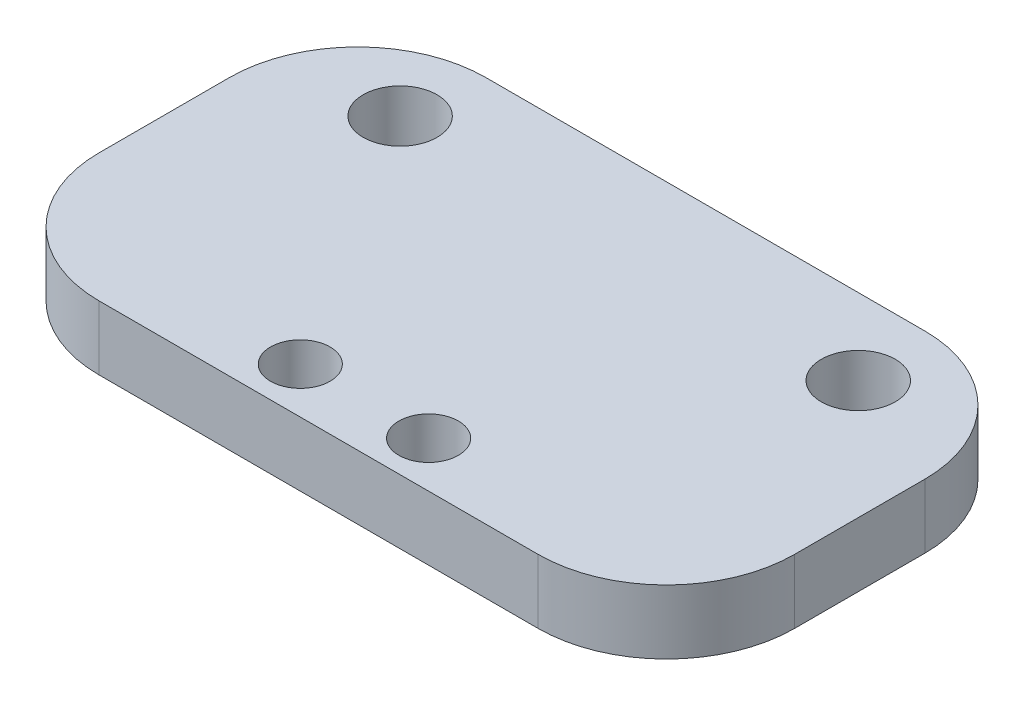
ISO-10303-21;
HEADER;
FILE_DESCRIPTION(('STEP AP214'),'2;1');
FILE_NAME('part.step','',(''),(''),'','','');
FILE_SCHEMA(('AUTOMOTIVE_DESIGN { 1 0 10303 214 1 1 1 1 }'));
ENDSEC;
DATA;
#1=APPLICATION_CONTEXT('core data for automotive mechanical design processes');
#2=APPLICATION_PROTOCOL_DEFINITION('international standard','automotive_design',2000,#1);
#3=PRODUCT_CONTEXT('',#1,'mechanical');
#4=PRODUCT('Part','Part','',(#3));
#5=PRODUCT_RELATED_PRODUCT_CATEGORY('part','',(#4));
#6=PRODUCT_DEFINITION_FORMATION('','',#4);
#7=PRODUCT_DEFINITION_CONTEXT('part definition',#1,'design');
#8=PRODUCT_DEFINITION('design','',#6,#7);
#9=PRODUCT_DEFINITION_SHAPE('','',#8);
#10=(LENGTH_UNIT() NAMED_UNIT(*) SI_UNIT(.MILLI.,.METRE.));
#11=(NAMED_UNIT(*) PLANE_ANGLE_UNIT() SI_UNIT($,.RADIAN.));
#12=(NAMED_UNIT(*) SI_UNIT($,.STERADIAN.) SOLID_ANGLE_UNIT());
#13=UNCERTAINTY_MEASURE_WITH_UNIT(LENGTH_MEASURE(1.E-05),#10,'distance_accuracy_value','');
#14=(GEOMETRIC_REPRESENTATION_CONTEXT(3) GLOBAL_UNCERTAINTY_ASSIGNED_CONTEXT((#13)) GLOBAL_UNIT_ASSIGNED_CONTEXT((#10,
#11,#12)) REPRESENTATION_CONTEXT('',''));
#15=CARTESIAN_POINT('',(0.,0.,0.));
#16=DIRECTION('',(0.,0.,1.));
#17=DIRECTION('',(1.,0.,0.));
#18=AXIS2_PLACEMENT_3D('',#15,#16,#17);
#19=CARTESIAN_POINT('',(-10.8593135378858,3.175,-35.0420649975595));
#20=DIRECTION('',(0.,1.,0.));
#21=DIRECTION('',(0.,0.,1.));
#22=AXIS2_PLACEMENT_3D('',#19,#20,#21);
#23=PLANE('',#22);
#24=CARTESIAN_POINT('',(-3.17500000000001,3.175,-24.520410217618));
#25=DIRECTION('',(0.,1.,0.));
#26=DIRECTION('',(0.,0.,1.));
#27=AXIS2_PLACEMENT_3D('',#24,#25,#26);
#28=CIRCLE('',#27,1.4732);
#29=CARTESIAN_POINT('',(-3.17500000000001,3.175,-23.047210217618));
#30=VERTEX_POINT('',#29);
#31=EDGE_CURVE('E186',#30,#30,#28,.T.);
#32=ORIENTED_EDGE('',*,*,#31,.F.);
#33=EDGE_LOOP('',(#32));
#34=FACE_BOUND('',#33,.T.);
#35=CARTESIAN_POINT('',(-11.3356124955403,3.175,-37.6203029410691));
#36=DIRECTION('',(0.,1.,0.));
#37=DIRECTION('',(0.,0.,1.));
#38=AXIS2_PLACEMENT_3D('',#35,#36,#37);
#39=CIRCLE('',#38,1.8288);
#40=CARTESIAN_POINT('',(-11.3356124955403,3.175,-35.7915029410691));
#41=VERTEX_POINT('',#40);
#42=EDGE_CURVE('E131',#41,#41,#39,.T.);
#43=ORIENTED_EDGE('',*,*,#42,.F.);
#44=EDGE_LOOP('',(#43));
#45=FACE_BOUND('',#44,.T.);
#46=CARTESIAN_POINT('',(-10.8593135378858,3.175,-35.0420649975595));
#47=DIRECTION('',(0.,1.,0.));
#48=DIRECTION('',(0.,0.,1.));
#49=AXIS2_PLACEMENT_3D('',#46,#47,#48);
#50=CIRCLE('',#49,6.35);
#51=CARTESIAN_POINT('',(-10.8593135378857,3.175,-41.3920649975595));
#52=VERTEX_POINT('',#51);
#53=CARTESIAN_POINT('',(-17.2093135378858,3.175,-35.0420649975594));
#54=VERTEX_POINT('',#53);
#55=EDGE_CURVE('E143',#52,#54,#50,.T.);
#56=ORIENTED_EDGE('',*,*,#55,.T.);
#57=DIRECTION('',(0.,0.,1.));
#58=VECTOR('',#57,1.);
#59=CARTESIAN_POINT('',(-17.2093135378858,3.175,-34.9960115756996));
#60=LINE('',#59,#58);
#61=CARTESIAN_POINT('',(-17.2093135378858,3.175,-28.5999581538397));
#62=VERTEX_POINT('',#61);
#63=EDGE_CURVE('E91',#54,#62,#60,.T.);
#64=ORIENTED_EDGE('',*,*,#63,.T.);
#65=CARTESIAN_POINT('',(-10.8593135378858,3.175,-28.5999581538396));
#66=DIRECTION('',(0.,1.,0.));
#67=DIRECTION('',(0.,0.,1.));
#68=AXIS2_PLACEMENT_3D('',#65,#66,#67);
#69=CIRCLE('',#68,6.35);
#70=CARTESIAN_POINT('',(-10.8593135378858,3.175,-22.2499581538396));
#71=VERTEX_POINT('',#70);
#72=EDGE_CURVE('E158',#62,#71,#69,.T.);
#73=ORIENTED_EDGE('',*,*,#72,.T.);
#74=DIRECTION('',(1.,0.,0.));
#75=VECTOR('',#74,1.);
#76=CARTESIAN_POINT('',(-10.8593135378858,3.175,-22.2499581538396));
#77=LINE('',#76,#75);
#78=CARTESIAN_POINT('',(10.8593135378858,3.175,-22.2499581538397));
#79=VERTEX_POINT('',#78);
#80=EDGE_CURVE('E171',#71,#79,#77,.T.);
#81=ORIENTED_EDGE('',*,*,#80,.T.);
#82=CARTESIAN_POINT('',(10.8593135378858,3.175,-28.5999581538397));
#83=DIRECTION('',(0.,1.,0.));
#84=DIRECTION('',(0.,0.,1.));
#85=AXIS2_PLACEMENT_3D('',#82,#83,#84);
#86=CIRCLE('',#85,6.35);
#87=CARTESIAN_POINT('',(17.2093135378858,3.175,-28.5999581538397));
#88=VERTEX_POINT('',#87);
#89=EDGE_CURVE('E110',#79,#88,#86,.T.);
#90=ORIENTED_EDGE('',*,*,#89,.T.);
#91=DIRECTION('',(0.,0.,-1.));
#92=VECTOR('',#91,1.);
#93=CARTESIAN_POINT('',(17.2093135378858,3.175,-28.5999581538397));
#94=LINE('',#93,#92);
#95=CARTESIAN_POINT('',(17.2093135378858,3.175,-35.0420649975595));
#96=VERTEX_POINT('',#95);
#97=EDGE_CURVE('E104',#88,#96,#94,.T.);
#98=ORIENTED_EDGE('',*,*,#97,.T.);
#99=CARTESIAN_POINT('',(10.8593135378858,3.175,-35.0420649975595));
#100=DIRECTION('',(0.,1.,0.));
#101=DIRECTION('',(0.,0.,-1.));
#102=AXIS2_PLACEMENT_3D('',#99,#100,#101);
#103=CIRCLE('',#102,6.35);
#104=CARTESIAN_POINT('',(10.8593135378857,3.175,-41.3920649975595));
#105=VERTEX_POINT('',#104);
#106=EDGE_CURVE('E108',#96,#105,#103,.T.);
#107=ORIENTED_EDGE('',*,*,#106,.T.);
#108=DIRECTION('',(-1.,0.,0.));
#109=VECTOR('',#108,1.);
#110=CARTESIAN_POINT('',(-10.8593135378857,3.175,-41.3920649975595));
#111=LINE('',#110,#109);
#112=EDGE_CURVE('E48',#105,#52,#111,.T.);
#113=ORIENTED_EDGE('',*,*,#112,.T.);
#114=EDGE_LOOP('',(#56,#64,#73,#81,#90,#98,#107,#113));
#115=FACE_BOUND('',#114,.T.);
#116=CARTESIAN_POINT('',(11.3356124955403,3.175,-37.6203029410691));
#117=DIRECTION('',(0.,1.,0.));
#118=DIRECTION('',(0.,0.,-1.));
#119=AXIS2_PLACEMENT_3D('',#116,#117,#118);
#120=CIRCLE('',#119,1.8288);
#121=CARTESIAN_POINT('',(11.3356124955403,3.175,-39.4491029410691));
#122=VERTEX_POINT('',#121);
#123=EDGE_CURVE('E180',#122,#122,#120,.T.);
#124=ORIENTED_EDGE('',*,*,#123,.F.);
#125=EDGE_LOOP('',(#124));
#126=FACE_BOUND('',#125,.T.);
#127=CARTESIAN_POINT('',(3.175,3.175,-24.520410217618));
#128=DIRECTION('',(0.,1.,0.));
#129=DIRECTION('',(0.,0.,-1.));
#130=AXIS2_PLACEMENT_3D('',#127,#128,#129);
#131=CIRCLE('',#130,1.4732);
#132=CARTESIAN_POINT('',(3.175,3.175,-25.993610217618));
#133=VERTEX_POINT('',#132);
#134=EDGE_CURVE('E192',#133,#133,#131,.T.);
#135=ORIENTED_EDGE('',*,*,#134,.F.);
#136=EDGE_LOOP('',(#135));
#137=FACE_BOUND('',#136,.T.);
#138=ADVANCED_FACE('F31',(#34,#45,#115,#126,#137),#23,.T.);
#139=CARTESIAN_POINT('',(-10.8593135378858,0.,-35.0420649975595));
#140=DIRECTION('',(0.,1.,0.));
#141=DIRECTION('',(0.,0.,1.));
#142=AXIS2_PLACEMENT_3D('',#139,#140,#141);
#143=PLANE('',#142);
#144=CARTESIAN_POINT('',(-3.17500000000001,0.,-24.520410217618));
#145=DIRECTION('',(0.,1.,0.));
#146=DIRECTION('',(0.,0.,1.));
#147=AXIS2_PLACEMENT_3D('',#144,#145,#146);
#148=CIRCLE('',#147,1.4732);
#149=CARTESIAN_POINT('',(-3.17500000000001,0.,-23.047210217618));
#150=VERTEX_POINT('',#149);
#151=EDGE_CURVE('E189',#150,#150,#148,.T.);
#152=ORIENTED_EDGE('',*,*,#151,.T.);
#153=EDGE_LOOP('',(#152));
#154=FACE_BOUND('',#153,.T.);
#155=CARTESIAN_POINT('',(-11.3356124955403,0.,-37.6203029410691));
#156=DIRECTION('',(0.,1.,0.));
#157=DIRECTION('',(0.,0.,1.));
#158=AXIS2_PLACEMENT_3D('',#155,#156,#157);
#159=CIRCLE('',#158,1.8288);
#160=CARTESIAN_POINT('',(-11.3356124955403,0.,-35.7915029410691));
#161=VERTEX_POINT('',#160);
#162=EDGE_CURVE('E177',#161,#161,#159,.T.);
#163=ORIENTED_EDGE('',*,*,#162,.T.);
#164=EDGE_LOOP('',(#163));
#165=FACE_BOUND('',#164,.T.);
#166=CARTESIAN_POINT('',(-10.8593135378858,0.,-35.0420649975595));
#167=DIRECTION('',(0.,1.,0.));
#168=DIRECTION('',(0.,0.,1.));
#169=AXIS2_PLACEMENT_3D('',#166,#167,#168);
#170=CIRCLE('',#169,6.35);
#171=CARTESIAN_POINT('',(-10.8593135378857,0.,-41.3920649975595));
#172=VERTEX_POINT('',#171);
#173=CARTESIAN_POINT('',(-17.2093135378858,0.,-35.0420649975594));
#174=VERTEX_POINT('',#173);
#175=EDGE_CURVE('E127',#172,#174,#170,.T.);
#176=ORIENTED_EDGE('',*,*,#175,.F.);
#177=DIRECTION('',(-1.,0.,0.));
#178=VECTOR('',#177,1.);
#179=CARTESIAN_POINT('',(-10.8593135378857,0.,-41.3920649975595));
#180=LINE('',#179,#178);
#181=CARTESIAN_POINT('',(10.8593135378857,0.,-41.3920649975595));
#182=VERTEX_POINT('',#181);
#183=EDGE_CURVE('E83',#182,#172,#180,.T.);
#184=ORIENTED_EDGE('',*,*,#183,.F.);
#185=CARTESIAN_POINT('',(10.8593135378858,0.,-35.0420649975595));
#186=DIRECTION('',(0.,1.,0.));
#187=DIRECTION('',(0.,0.,-1.));
#188=AXIS2_PLACEMENT_3D('',#185,#186,#187);
#189=CIRCLE('',#188,6.35);
#190=CARTESIAN_POINT('',(17.2093135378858,0.,-35.0420649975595));
#191=VERTEX_POINT('',#190);
#192=EDGE_CURVE('E77',#191,#182,#189,.T.);
#193=ORIENTED_EDGE('',*,*,#192,.F.);
#194=DIRECTION('',(0.,0.,-1.));
#195=VECTOR('',#194,1.);
#196=CARTESIAN_POINT('',(17.2093135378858,0.,-34.9960115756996));
#197=LINE('',#196,#195);
#198=CARTESIAN_POINT('',(17.2093135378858,0.,-28.5999581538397));
#199=VERTEX_POINT('',#198);
#200=EDGE_CURVE('E117',#199,#191,#197,.T.);
#201=ORIENTED_EDGE('',*,*,#200,.F.);
#202=CARTESIAN_POINT('',(10.8593135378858,0.,-28.5999581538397));
#203=DIRECTION('',(0.,1.,0.));
#204=DIRECTION('',(0.,0.,1.));
#205=AXIS2_PLACEMENT_3D('',#202,#203,#204);
#206=CIRCLE('',#205,6.35);
#207=CARTESIAN_POINT('',(10.8593135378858,0.,-22.2499581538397));
#208=VERTEX_POINT('',#207);
#209=EDGE_CURVE('E137',#208,#199,#206,.T.);
#210=ORIENTED_EDGE('',*,*,#209,.F.);
#211=DIRECTION('',(1.,0.,0.));
#212=VECTOR('',#211,1.);
#213=CARTESIAN_POINT('',(-10.8593135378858,0.,-22.2499581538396));
#214=LINE('',#213,#212);
#215=CARTESIAN_POINT('',(-10.8593135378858,0.,-22.2499581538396));
#216=VERTEX_POINT('',#215);
#217=EDGE_CURVE('E135',#216,#208,#214,.T.);
#218=ORIENTED_EDGE('',*,*,#217,.F.);
#219=CARTESIAN_POINT('',(-10.8593135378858,0.,-28.5999581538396));
#220=DIRECTION('',(0.,1.,0.));
#221=DIRECTION('',(0.,0.,1.));
#222=AXIS2_PLACEMENT_3D('',#219,#220,#221);
#223=CIRCLE('',#222,6.35);
#224=CARTESIAN_POINT('',(-17.2093135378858,0.,-28.5999581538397));
#225=VERTEX_POINT('',#224);
#226=EDGE_CURVE('E133',#225,#216,#223,.T.);
#227=ORIENTED_EDGE('',*,*,#226,.F.);
#228=DIRECTION('',(0.,0.,1.));
#229=VECTOR('',#228,1.);
#230=CARTESIAN_POINT('',(-17.2093135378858,0.,-34.9960115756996));
#231=LINE('',#230,#229);
#232=EDGE_CURVE('E130',#174,#225,#231,.T.);
#233=ORIENTED_EDGE('',*,*,#232,.F.);
#234=EDGE_LOOP('',(#176,#184,#193,#201,#210,#218,#227,#233));
#235=FACE_BOUND('',#234,.T.);
#236=CARTESIAN_POINT('',(11.3356124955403,0.,-37.6203029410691));
#237=DIRECTION('',(0.,1.,0.));
#238=DIRECTION('',(0.,0.,-1.));
#239=AXIS2_PLACEMENT_3D('',#236,#237,#238);
#240=CIRCLE('',#239,1.8288);
#241=CARTESIAN_POINT('',(11.3356124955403,0.,-39.4491029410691));
#242=VERTEX_POINT('',#241);
#243=EDGE_CURVE('E183',#242,#242,#240,.T.);
#244=ORIENTED_EDGE('',*,*,#243,.T.);
#245=EDGE_LOOP('',(#244));
#246=FACE_BOUND('',#245,.T.);
#247=CARTESIAN_POINT('',(3.175,0.,-24.520410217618));
#248=DIRECTION('',(0.,1.,0.));
#249=DIRECTION('',(0.,0.,-1.));
#250=AXIS2_PLACEMENT_3D('',#247,#248,#249);
#251=CIRCLE('',#250,1.4732);
#252=CARTESIAN_POINT('',(3.175,0.,-25.993610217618));
#253=VERTEX_POINT('',#252);
#254=EDGE_CURVE('E195',#253,#253,#251,.T.);
#255=ORIENTED_EDGE('',*,*,#254,.T.);
#256=EDGE_LOOP('',(#255));
#257=FACE_BOUND('',#256,.T.);
#258=ADVANCED_FACE('F162',(#154,#165,#235,#246,#257),#143,.F.);
#259=CARTESIAN_POINT('',(-10.8593135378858,3.175,-35.0420649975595));
#260=DIRECTION('',(0.,-1.,0.));
#261=DIRECTION('',(0.,0.,-1.));
#262=AXIS2_PLACEMENT_3D('',#259,#260,#261);
#263=CYLINDRICAL_SURFACE('',#262,6.35);
#264=ORIENTED_EDGE('',*,*,#175,.T.);
#265=DIRECTION('',(0.,-1.,0.));
#266=VECTOR('',#265,1.);
#267=CARTESIAN_POINT('',(-17.2093135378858,3.175,-35.0420649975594));
#268=LINE('',#267,#266);
#269=EDGE_CURVE('E11',#54,#174,#268,.T.);
#270=ORIENTED_EDGE('',*,*,#269,.F.);
#271=ORIENTED_EDGE('',*,*,#55,.F.);
#272=DIRECTION('',(0.,-1.,0.));
#273=VECTOR('',#272,1.);
#274=CARTESIAN_POINT('',(-10.8593135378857,3.175,-41.3920649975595));
#275=LINE('',#274,#273);
#276=EDGE_CURVE('E123',#52,#172,#275,.T.);
#277=ORIENTED_EDGE('',*,*,#276,.T.);
#278=EDGE_LOOP('',(#264,#270,#271,#277));
#279=FACE_BOUND('',#278,.T.);
#280=ADVANCED_FACE('F33',(#279),#263,.T.);
#281=CARTESIAN_POINT('',(-17.2093135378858,3.175,-34.9960115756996));
#282=DIRECTION('',(1.,0.,0.));
#283=DIRECTION('',(0.,0.,-1.));
#284=AXIS2_PLACEMENT_3D('',#281,#282,#283);
#285=PLANE('',#284);
#286=ORIENTED_EDGE('',*,*,#232,.T.);
#287=DIRECTION('',(0.,-1.,0.));
#288=VECTOR('',#287,1.);
#289=CARTESIAN_POINT('',(-17.2093135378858,3.175,-28.5999581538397));
#290=LINE('',#289,#288);
#291=EDGE_CURVE('E40',#62,#225,#290,.T.);
#292=ORIENTED_EDGE('',*,*,#291,.F.);
#293=ORIENTED_EDGE('',*,*,#63,.F.);
#294=ORIENTED_EDGE('',*,*,#269,.T.);
#295=EDGE_LOOP('',(#286,#292,#293,#294));
#296=FACE_BOUND('',#295,.T.);
#297=ADVANCED_FACE('F230',(#296),#285,.F.);
#298=CARTESIAN_POINT('',(-10.8593135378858,3.175,-28.5999581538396));
#299=DIRECTION('',(0.,-1.,0.));
#300=DIRECTION('',(0.,0.,-1.));
#301=AXIS2_PLACEMENT_3D('',#298,#299,#300);
#302=CYLINDRICAL_SURFACE('',#301,6.35);
#303=ORIENTED_EDGE('',*,*,#226,.T.);
#304=DIRECTION('',(0.,-1.,0.));
#305=VECTOR('',#304,1.);
#306=CARTESIAN_POINT('',(-10.8593135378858,3.175,-22.2499581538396));
#307=LINE('',#306,#305);
#308=EDGE_CURVE('E150',#71,#216,#307,.T.);
#309=ORIENTED_EDGE('',*,*,#308,.F.);
#310=ORIENTED_EDGE('',*,*,#72,.F.);
#311=ORIENTED_EDGE('',*,*,#291,.T.);
#312=EDGE_LOOP('',(#303,#309,#310,#311));
#313=FACE_BOUND('',#312,.T.);
#314=ADVANCED_FACE('F156',(#313),#302,.T.);
#315=CARTESIAN_POINT('',(-10.8593135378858,3.175,-22.2499581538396));
#316=DIRECTION('',(0.,0.,-1.));
#317=DIRECTION('',(-1.,0.,0.));
#318=AXIS2_PLACEMENT_3D('',#315,#316,#317);
#319=PLANE('',#318);
#320=ORIENTED_EDGE('',*,*,#217,.T.);
#321=DIRECTION('',(0.,-1.,0.));
#322=VECTOR('',#321,1.);
#323=CARTESIAN_POINT('',(10.8593135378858,3.175,-22.2499581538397));
#324=LINE('',#323,#322);
#325=EDGE_CURVE('E147',#79,#208,#324,.T.);
#326=ORIENTED_EDGE('',*,*,#325,.F.);
#327=ORIENTED_EDGE('',*,*,#80,.F.);
#328=ORIENTED_EDGE('',*,*,#308,.T.);
#329=EDGE_LOOP('',(#320,#326,#327,#328));
#330=FACE_BOUND('',#329,.T.);
#331=ADVANCED_FACE('F167',(#330),#319,.F.);
#332=CARTESIAN_POINT('',(10.8593135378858,3.175,-28.5999581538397));
#333=DIRECTION('',(0.,-1.,0.));
#334=DIRECTION('',(0.,0.,-1.));
#335=AXIS2_PLACEMENT_3D('',#332,#333,#334);
#336=CYLINDRICAL_SURFACE('',#335,6.35);
#337=ORIENTED_EDGE('',*,*,#209,.T.);
#338=DIRECTION('',(0.,-1.,0.));
#339=VECTOR('',#338,1.);
#340=CARTESIAN_POINT('',(17.2093135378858,3.175,-28.5999581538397));
#341=LINE('',#340,#339);
#342=EDGE_CURVE('E118',#88,#199,#341,.T.);
#343=ORIENTED_EDGE('',*,*,#342,.F.);
#344=ORIENTED_EDGE('',*,*,#89,.F.);
#345=ORIENTED_EDGE('',*,*,#325,.T.);
#346=EDGE_LOOP('',(#337,#343,#344,#345));
#347=FACE_BOUND('',#346,.T.);
#348=ADVANCED_FACE('F170',(#347),#336,.T.);
#349=CARTESIAN_POINT('',(17.2093135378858,3.175,-34.9960115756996));
#350=DIRECTION('',(-1.,0.,0.));
#351=DIRECTION('',(0.,0.,1.));
#352=AXIS2_PLACEMENT_3D('',#349,#350,#351);
#353=PLANE('',#352);
#354=ORIENTED_EDGE('',*,*,#200,.T.);
#355=DIRECTION('',(0.,-1.,0.));
#356=VECTOR('',#355,1.);
#357=CARTESIAN_POINT('',(17.2093135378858,3.175,-35.0420649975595));
#358=LINE('',#357,#356);
#359=EDGE_CURVE('E115',#96,#191,#358,.T.);
#360=ORIENTED_EDGE('',*,*,#359,.F.);
#361=ORIENTED_EDGE('',*,*,#97,.F.);
#362=ORIENTED_EDGE('',*,*,#342,.T.);
#363=EDGE_LOOP('',(#354,#360,#361,#362));
#364=FACE_BOUND('',#363,.T.);
#365=ADVANCED_FACE('F116',(#364),#353,.F.);
#366=CARTESIAN_POINT('',(10.8593135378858,3.175,-35.0420649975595));
#367=DIRECTION('',(0.,-1.,0.));
#368=DIRECTION('',(0.,0.,-1.));
#369=AXIS2_PLACEMENT_3D('',#366,#367,#368);
#370=CYLINDRICAL_SURFACE('',#369,6.35);
#371=ORIENTED_EDGE('',*,*,#192,.T.);
#372=DIRECTION('',(0.,-1.,0.));
#373=VECTOR('',#372,1.);
#374=CARTESIAN_POINT('',(10.8593135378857,3.175,-41.3920649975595));
#375=LINE('',#374,#373);
#376=EDGE_CURVE('E119',#105,#182,#375,.T.);
#377=ORIENTED_EDGE('',*,*,#376,.F.);
#378=ORIENTED_EDGE('',*,*,#106,.F.);
#379=ORIENTED_EDGE('',*,*,#359,.T.);
#380=EDGE_LOOP('',(#371,#377,#378,#379));
#381=FACE_BOUND('',#380,.T.);
#382=ADVANCED_FACE('F121',(#381),#370,.T.);
#383=CARTESIAN_POINT('',(-10.8593135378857,3.175,-41.3920649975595));
#384=DIRECTION('',(0.,0.,1.));
#385=DIRECTION('',(1.,0.,0.));
#386=AXIS2_PLACEMENT_3D('',#383,#384,#385);
#387=PLANE('',#386);
#388=ORIENTED_EDGE('',*,*,#183,.T.);
#389=ORIENTED_EDGE('',*,*,#276,.F.);
#390=ORIENTED_EDGE('',*,*,#112,.F.);
#391=ORIENTED_EDGE('',*,*,#376,.T.);
#392=EDGE_LOOP('',(#388,#389,#390,#391));
#393=FACE_BOUND('',#392,.T.);
#394=ADVANCED_FACE('F218',(#393),#387,.F.);
#395=CARTESIAN_POINT('',(-11.3356124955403,3.175,-37.6203029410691));
#396=DIRECTION('',(0.,-1.,0.));
#397=DIRECTION('',(0.,0.,-1.));
#398=AXIS2_PLACEMENT_3D('',#395,#396,#397);
#399=CYLINDRICAL_SURFACE('',#398,1.8288);
#400=ORIENTED_EDGE('',*,*,#42,.T.);
#401=EDGE_LOOP('',(#400));
#402=FACE_BOUND('',#401,.T.);
#403=ORIENTED_EDGE('',*,*,#162,.F.);
#404=EDGE_LOOP('',(#403));
#405=FACE_BOUND('',#404,.T.);
#406=ADVANCED_FACE('F215',(#402,#405),#399,.F.);
#407=CARTESIAN_POINT('',(11.3356124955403,3.175,-37.6203029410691));
#408=DIRECTION('',(0.,-1.,0.));
#409=DIRECTION('',(0.,0.,-1.));
#410=AXIS2_PLACEMENT_3D('',#407,#408,#409);
#411=CYLINDRICAL_SURFACE('',#410,1.8288);
#412=ORIENTED_EDGE('',*,*,#123,.T.);
#413=EDGE_LOOP('',(#412));
#414=FACE_BOUND('',#413,.T.);
#415=ORIENTED_EDGE('',*,*,#243,.F.);
#416=EDGE_LOOP('',(#415));
#417=FACE_BOUND('',#416,.T.);
#418=ADVANCED_FACE('F300',(#414,#417),#411,.F.);
#419=CARTESIAN_POINT('',(-3.17500000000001,3.175,-24.520410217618));
#420=DIRECTION('',(0.,-1.,0.));
#421=DIRECTION('',(0.,0.,-1.));
#422=AXIS2_PLACEMENT_3D('',#419,#420,#421);
#423=CYLINDRICAL_SURFACE('',#422,1.4732);
#424=ORIENTED_EDGE('',*,*,#31,.T.);
#425=EDGE_LOOP('',(#424));
#426=FACE_BOUND('',#425,.T.);
#427=ORIENTED_EDGE('',*,*,#151,.F.);
#428=EDGE_LOOP('',(#427));
#429=FACE_BOUND('',#428,.T.);
#430=ADVANCED_FACE('F308',(#426,#429),#423,.F.);
#431=CARTESIAN_POINT('',(3.175,3.175,-24.520410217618));
#432=DIRECTION('',(0.,-1.,0.));
#433=DIRECTION('',(0.,0.,-1.));
#434=AXIS2_PLACEMENT_3D('',#431,#432,#433);
#435=CYLINDRICAL_SURFACE('',#434,1.4732);
#436=ORIENTED_EDGE('',*,*,#134,.T.);
#437=EDGE_LOOP('',(#436));
#438=FACE_BOUND('',#437,.T.);
#439=ORIENTED_EDGE('',*,*,#254,.F.);
#440=EDGE_LOOP('',(#439));
#441=FACE_BOUND('',#440,.T.);
#442=ADVANCED_FACE('F201',(#438,#441),#435,.F.);
#443=CLOSED_SHELL('',(#138,#258,#280,#297,#314,#331,#348,#365,#382,#394,#406,#418,#430,#442));
#444=MANIFOLD_SOLID_BREP('B2',#443);
#445=ADVANCED_BREP_SHAPE_REPRESENTATION('',(#18,#444),#14);
#446=SHAPE_DEFINITION_REPRESENTATION(#9,#445);
ENDSEC;
END-ISO-10303-21;
